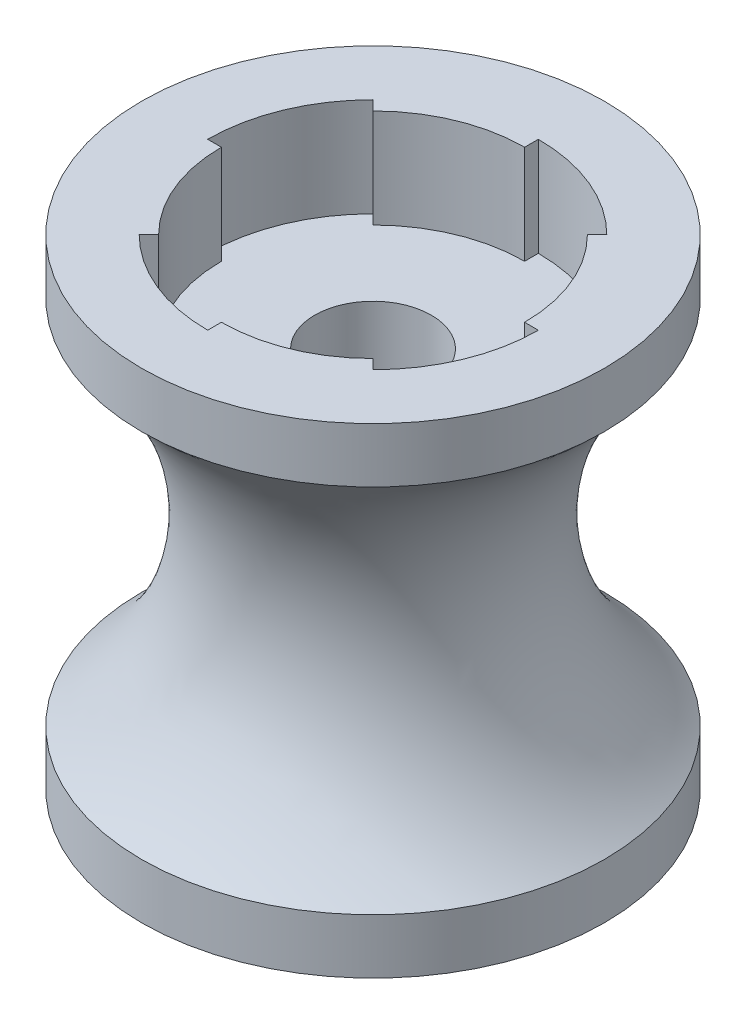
ISO-10303-21;
HEADER;
FILE_DESCRIPTION(('STEP AP214'),'2;1');
FILE_NAME('part.step','',(''),(''),'','','');
FILE_SCHEMA(('AUTOMOTIVE_DESIGN { 1 0 10303 214 1 1 1 1 }'));
ENDSEC;
DATA;
#1=APPLICATION_CONTEXT('core data for automotive mechanical design processes');
#2=APPLICATION_PROTOCOL_DEFINITION('international standard','automotive_design',2000,#1);
#3=PRODUCT_CONTEXT('',#1,'mechanical');
#4=PRODUCT('Part','Part','',(#3));
#5=PRODUCT_RELATED_PRODUCT_CATEGORY('part','',(#4));
#6=PRODUCT_DEFINITION_FORMATION('','',#4);
#7=PRODUCT_DEFINITION_CONTEXT('part definition',#1,'design');
#8=PRODUCT_DEFINITION('design','',#6,#7);
#9=PRODUCT_DEFINITION_SHAPE('','',#8);
#10=(LENGTH_UNIT() NAMED_UNIT(*) SI_UNIT(.MILLI.,.METRE.));
#11=(NAMED_UNIT(*) PLANE_ANGLE_UNIT() SI_UNIT($,.RADIAN.));
#12=(NAMED_UNIT(*) SI_UNIT($,.STERADIAN.) SOLID_ANGLE_UNIT());
#13=UNCERTAINTY_MEASURE_WITH_UNIT(LENGTH_MEASURE(1.E-05),#10,'distance_accuracy_value','');
#14=(GEOMETRIC_REPRESENTATION_CONTEXT(3) GLOBAL_UNCERTAINTY_ASSIGNED_CONTEXT((#13)) GLOBAL_UNIT_ASSIGNED_CONTEXT((#10,
#11,#12)) REPRESENTATION_CONTEXT('',''));
#15=CARTESIAN_POINT('',(0.,0.,0.));
#16=DIRECTION('',(0.,0.,1.));
#17=DIRECTION('',(1.,0.,0.));
#18=AXIS2_PLACEMENT_3D('',#15,#16,#17);
#19=CARTESIAN_POINT('',(0.,0.,0.));
#20=DIRECTION('',(0.,1.,0.));
#21=DIRECTION('',(0.,0.,1.));
#22=AXIS2_PLACEMENT_3D('',#19,#20,#21);
#23=PLANE('',#22);
#24=CARTESIAN_POINT('',(0.,0.,0.));
#25=DIRECTION('',(0.,-1.,0.));
#26=DIRECTION('',(0.,0.,-1.));
#27=AXIS2_PLACEMENT_3D('',#24,#25,#26);
#28=CIRCLE('',#27,16.8644712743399);
#29=CARTESIAN_POINT('',(0.,0.,-16.8644712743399));
#30=VERTEX_POINT('',#29);
#31=EDGE_CURVE('E11',#30,#30,#28,.T.);
#32=ORIENTED_EDGE('',*,*,#31,.T.);
#33=EDGE_LOOP('',(#32));
#34=FACE_BOUND('',#33,.T.);
#35=DIRECTION('',(1.,0.,0.));
#36=VECTOR('',#35,1.);
#37=CARTESIAN_POINT('',(0.,0.,0.));
#38=LINE('',#37,#36);
#39=CARTESIAN_POINT('',(-12.05,0.,0.));
#40=VERTEX_POINT('',#39);
#41=CARTESIAN_POINT('',(-11.05,0.,0.));
#42=VERTEX_POINT('',#41);
#43=EDGE_CURVE('E390',#40,#42,#38,.T.);
#44=ORIENTED_EDGE('',*,*,#43,.T.);
#45=CARTESIAN_POINT('',(0.,0.,0.));
#46=DIRECTION('',(0.,-1.,0.));
#47=DIRECTION('',(0.,0.,-1.));
#48=AXIS2_PLACEMENT_3D('',#45,#46,#47);
#49=CIRCLE('',#48,11.05);
#50=CARTESIAN_POINT('',(-7.81352993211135,0.,7.81352993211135));
#51=VERTEX_POINT('',#50);
#52=EDGE_CURVE('E479',#51,#42,#49,.T.);
#53=ORIENTED_EDGE('',*,*,#52,.F.);
#54=DIRECTION('',(0.707106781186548,0.,-0.707106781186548));
#55=VECTOR('',#54,1.);
#56=CARTESIAN_POINT('',(0.,0.,0.));
#57=LINE('',#56,#55);
#58=CARTESIAN_POINT('',(-8.5206367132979,0.,8.5206367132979));
#59=VERTEX_POINT('',#58);
#60=EDGE_CURVE('E458',#59,#51,#57,.T.);
#61=ORIENTED_EDGE('',*,*,#60,.F.);
#62=CARTESIAN_POINT('',(0.,0.,0.));
#63=DIRECTION('',(0.,-1.,0.));
#64=DIRECTION('',(0.,0.,-1.));
#65=AXIS2_PLACEMENT_3D('',#62,#63,#64);
#66=CIRCLE('',#65,12.05);
#67=CARTESIAN_POINT('',(0.,0.,12.05));
#68=VERTEX_POINT('',#67);
#69=EDGE_CURVE('E402',#59,#68,#66,.F.);
#70=ORIENTED_EDGE('',*,*,#69,.T.);
#71=DIRECTION('',(0.,0.,-1.));
#72=VECTOR('',#71,1.);
#73=CARTESIAN_POINT('',(0.,0.,0.));
#74=LINE('',#73,#72);
#75=CARTESIAN_POINT('',(0.,0.,11.05));
#76=VERTEX_POINT('',#75);
#77=EDGE_CURVE('E460',#68,#76,#74,.T.);
#78=ORIENTED_EDGE('',*,*,#77,.T.);
#79=CARTESIAN_POINT('',(7.81352993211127,0.,7.81352993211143));
#80=VERTEX_POINT('',#79);
#81=EDGE_CURVE('E473',#80,#76,#49,.T.);
#82=ORIENTED_EDGE('',*,*,#81,.F.);
#83=DIRECTION('',(-0.70710678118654,0.,-0.707106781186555));
#84=VECTOR('',#83,1.);
#85=CARTESIAN_POINT('',(0.,0.,0.));
#86=LINE('',#85,#84);
#87=CARTESIAN_POINT('',(8.52063671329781,0.,8.52063671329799));
#88=VERTEX_POINT('',#87);
#89=EDGE_CURVE('E434',#88,#80,#86,.T.);
#90=ORIENTED_EDGE('',*,*,#89,.F.);
#91=CARTESIAN_POINT('',(0.,0.,0.));
#92=DIRECTION('',(0.,-1.,0.));
#93=DIRECTION('',(-1.,0.,0.));
#94=AXIS2_PLACEMENT_3D('',#91,#92,#93);
#95=CIRCLE('',#94,12.05);
#96=CARTESIAN_POINT('',(12.05,0.,1.26217050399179E-13));
#97=VERTEX_POINT('',#96);
#98=EDGE_CURVE('E374',#88,#97,#95,.F.);
#99=ORIENTED_EDGE('',*,*,#98,.T.);
#100=DIRECTION('',(-1.,0.,0.));
#101=VECTOR('',#100,1.);
#102=CARTESIAN_POINT('',(0.,0.,0.));
#103=LINE('',#102,#101);
#104=CARTESIAN_POINT('',(11.05,0.,1.1574260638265E-13));
#105=VERTEX_POINT('',#104);
#106=EDGE_CURVE('E436',#97,#105,#103,.T.);
#107=ORIENTED_EDGE('',*,*,#106,.T.);
#108=CARTESIAN_POINT('',(7.81352993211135,0.,-7.81352993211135));
#109=VERTEX_POINT('',#108);
#110=EDGE_CURVE('E554',#109,#105,#49,.T.);
#111=ORIENTED_EDGE('',*,*,#110,.F.);
#112=DIRECTION('',(-0.707106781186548,0.,0.707106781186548));
#113=VECTOR('',#112,1.);
#114=CARTESIAN_POINT('',(0.,0.,0.));
#115=LINE('',#114,#113);
#116=CARTESIAN_POINT('',(8.5206367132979,0.,-8.5206367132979));
#117=VERTEX_POINT('',#116);
#118=EDGE_CURVE('E412',#117,#109,#115,.T.);
#119=ORIENTED_EDGE('',*,*,#118,.F.);
#120=CARTESIAN_POINT('',(0.,0.,0.));
#121=DIRECTION('',(0.,-1.,0.));
#122=DIRECTION('',(0.,0.,1.));
#123=AXIS2_PLACEMENT_3D('',#120,#121,#122);
#124=CIRCLE('',#123,12.05);
#125=CARTESIAN_POINT('',(0.,0.,-12.05));
#126=VERTEX_POINT('',#125);
#127=EDGE_CURVE('E409',#117,#126,#124,.F.);
#128=ORIENTED_EDGE('',*,*,#127,.T.);
#129=DIRECTION('',(0.,0.,1.));
#130=VECTOR('',#129,1.);
#131=CARTESIAN_POINT('',(0.,0.,0.));
#132=LINE('',#131,#130);
#133=CARTESIAN_POINT('',(0.,0.,-11.05));
#134=VERTEX_POINT('',#133);
#135=EDGE_CURVE('E414',#126,#134,#132,.T.);
#136=ORIENTED_EDGE('',*,*,#135,.T.);
#137=CARTESIAN_POINT('',(-7.81352993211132,0.,-7.81352993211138));
#138=VERTEX_POINT('',#137);
#139=EDGE_CURVE('E482',#138,#134,#49,.T.);
#140=ORIENTED_EDGE('',*,*,#139,.F.);
#141=DIRECTION('',(0.707106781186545,0.,0.70710678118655));
#142=VECTOR('',#141,1.);
#143=CARTESIAN_POINT('',(0.,0.,0.));
#144=LINE('',#143,#142);
#145=CARTESIAN_POINT('',(-8.52063671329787,0.,-8.52063671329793));
#146=VERTEX_POINT('',#145);
#147=EDGE_CURVE('E388',#146,#138,#144,.T.);
#148=ORIENTED_EDGE('',*,*,#147,.F.);
#149=CARTESIAN_POINT('',(0.,0.,0.));
#150=DIRECTION('',(0.,-1.,0.));
#151=DIRECTION('',(1.,0.,0.));
#152=AXIS2_PLACEMENT_3D('',#149,#150,#151);
#153=CIRCLE('',#152,12.05);
#154=EDGE_CURVE('E385',#146,#40,#153,.F.);
#155=ORIENTED_EDGE('',*,*,#154,.T.);
#156=EDGE_LOOP('',(#44,#53,#61,#70,#78,#82,#90,#99,#107,#111,#119,#128,#136,#140,#148,#155));
#157=FACE_BOUND('',#156,.T.);
#158=ADVANCED_FACE('F34',(#34,#157),#23,.F.);
#159=CARTESIAN_POINT('',(0.,7.2,0.));
#160=DIRECTION('',(0.,-1.,0.));
#161=DIRECTION('',(0.,0.,-1.));
#162=AXIS2_PLACEMENT_3D('',#159,#160,#161);
#163=CYLINDRICAL_SURFACE('',#162,11.05);
#164=DIRECTION('',(0.,-1.,0.));
#165=VECTOR('',#164,1.);
#166=CARTESIAN_POINT('',(-11.05,16.7157200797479,0.));
#167=LINE('',#166,#165);
#168=CARTESIAN_POINT('',(-11.05,7.2,0.));
#169=VERTEX_POINT('',#168);
#170=EDGE_CURVE('E395',#169,#42,#167,.T.);
#171=ORIENTED_EDGE('',*,*,#170,.F.);
#172=CARTESIAN_POINT('',(0.,7.2,0.));
#173=DIRECTION('',(0.,-1.,0.));
#174=DIRECTION('',(0.,0.,-1.));
#175=AXIS2_PLACEMENT_3D('',#172,#173,#174);
#176=CIRCLE('',#175,11.05);
#177=CARTESIAN_POINT('',(-7.81352993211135,7.2,7.81352993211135));
#178=VERTEX_POINT('',#177);
#179=EDGE_CURVE('E474',#178,#169,#176,.T.);
#180=ORIENTED_EDGE('',*,*,#179,.F.);
#181=DIRECTION('',(0.,-1.,0.));
#182=VECTOR('',#181,1.);
#183=CARTESIAN_POINT('',(-7.81352993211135,16.7157200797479,7.81352993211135));
#184=LINE('',#183,#182);
#185=EDGE_CURVE('E468',#178,#51,#184,.T.);
#186=ORIENTED_EDGE('',*,*,#185,.T.);
#187=ORIENTED_EDGE('',*,*,#52,.T.);
#188=EDGE_LOOP('',(#171,#180,#186,#187));
#189=FACE_BOUND('',#188,.T.);
#190=ADVANCED_FACE('F518',(#189),#163,.F.);
#191=CARTESIAN_POINT('',(-7.81352993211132,7.2,-7.81352993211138));
#192=VERTEX_POINT('',#191);
#193=CARTESIAN_POINT('',(0.,7.2,-11.05));
#194=VERTEX_POINT('',#193);
#195=EDGE_CURVE('E477',#192,#194,#176,.T.);
#196=ORIENTED_EDGE('',*,*,#195,.F.);
#197=DIRECTION('',(0.,-1.,0.));
#198=VECTOR('',#197,1.);
#199=CARTESIAN_POINT('',(-7.81352993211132,16.7157200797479,-7.81352993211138));
#200=LINE('',#199,#198);
#201=EDGE_CURVE('E397',#192,#138,#200,.T.);
#202=ORIENTED_EDGE('',*,*,#201,.T.);
#203=ORIENTED_EDGE('',*,*,#139,.T.);
#204=DIRECTION('',(0.,-1.,0.));
#205=VECTOR('',#204,1.);
#206=CARTESIAN_POINT('',(0.,16.7157200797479,-11.05));
#207=LINE('',#206,#205);
#208=EDGE_CURVE('E419',#194,#134,#207,.T.);
#209=ORIENTED_EDGE('',*,*,#208,.F.);
#210=EDGE_LOOP('',(#196,#202,#203,#209));
#211=FACE_BOUND('',#210,.T.);
#212=ADVANCED_FACE('F523',(#211),#163,.F.);
#213=CARTESIAN_POINT('',(7.81352993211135,7.2,-7.81352993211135));
#214=VERTEX_POINT('',#213);
#215=CARTESIAN_POINT('',(11.05,7.2,1.15737990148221E-13));
#216=VERTEX_POINT('',#215);
#217=EDGE_CURVE('E573',#214,#216,#176,.T.);
#218=ORIENTED_EDGE('',*,*,#217,.F.);
#219=DIRECTION('',(0.,-1.,0.));
#220=VECTOR('',#219,1.);
#221=CARTESIAN_POINT('',(7.81352993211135,16.7157200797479,-7.81352993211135));
#222=LINE('',#221,#220);
#223=EDGE_CURVE('E421',#214,#109,#222,.T.);
#224=ORIENTED_EDGE('',*,*,#223,.T.);
#225=ORIENTED_EDGE('',*,*,#110,.T.);
#226=DIRECTION('',(0.,-1.,0.));
#227=VECTOR('',#226,1.);
#228=CARTESIAN_POINT('',(11.05,16.7157200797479,1.15733373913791E-13));
#229=LINE('',#228,#227);
#230=EDGE_CURVE('E441',#216,#105,#229,.T.);
#231=ORIENTED_EDGE('',*,*,#230,.F.);
#232=EDGE_LOOP('',(#218,#224,#225,#231));
#233=FACE_BOUND('',#232,.T.);
#234=ADVANCED_FACE('F625',(#233),#163,.F.);
#235=CARTESIAN_POINT('',(7.81352993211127,7.2,7.81352993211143));
#236=VERTEX_POINT('',#235);
#237=CARTESIAN_POINT('',(0.,7.2,11.05));
#238=VERTEX_POINT('',#237);
#239=EDGE_CURVE('E478',#236,#238,#176,.T.);
#240=ORIENTED_EDGE('',*,*,#239,.F.);
#241=DIRECTION('',(0.,-1.,0.));
#242=VECTOR('',#241,1.);
#243=CARTESIAN_POINT('',(7.81352993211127,16.7157200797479,7.81352993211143));
#244=LINE('',#243,#242);
#245=EDGE_CURVE('E443',#236,#80,#244,.T.);
#246=ORIENTED_EDGE('',*,*,#245,.T.);
#247=ORIENTED_EDGE('',*,*,#81,.T.);
#248=DIRECTION('',(0.,-1.,0.));
#249=VECTOR('',#248,1.);
#250=CARTESIAN_POINT('',(0.,16.7157200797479,11.05));
#251=LINE('',#250,#249);
#252=EDGE_CURVE('E465',#238,#76,#251,.T.);
#253=ORIENTED_EDGE('',*,*,#252,.F.);
#254=EDGE_LOOP('',(#240,#246,#247,#253));
#255=FACE_BOUND('',#254,.T.);
#256=ADVANCED_FACE('F495',(#255),#163,.F.);
#257=CARTESIAN_POINT('',(0.,87.,0.));
#258=DIRECTION('',(0.,-1.,0.));
#259=DIRECTION('',(0.,0.,-1.));
#260=AXIS2_PLACEMENT_3D('',#257,#258,#259);
#261=CYLINDRICAL_SURFACE('',#260,4.25);
#262=CARTESIAN_POINT('',(0.,7.2,0.));
#263=DIRECTION('',(0.,-1.,0.));
#264=DIRECTION('',(0.,0.,-1.));
#265=AXIS2_PLACEMENT_3D('',#262,#263,#264);
#266=CIRCLE('',#265,4.25);
#267=CARTESIAN_POINT('',(0.,7.2,-4.25));
#268=VERTEX_POINT('',#267);
#269=EDGE_CURVE('E37',#268,#268,#266,.F.);
#270=ORIENTED_EDGE('',*,*,#269,.F.);
#271=EDGE_LOOP('',(#270));
#272=FACE_BOUND('',#271,.T.);
#273=CARTESIAN_POINT('',(0.,27.8,0.));
#274=DIRECTION('',(0.,-1.,0.));
#275=DIRECTION('',(0.,0.,-1.));
#276=AXIS2_PLACEMENT_3D('',#273,#274,#275);
#277=CIRCLE('',#276,4.25);
#278=CARTESIAN_POINT('',(0.,27.8,-4.25));
#279=VERTEX_POINT('',#278);
#280=EDGE_CURVE('E362',#279,#279,#277,.F.);
#281=ORIENTED_EDGE('',*,*,#280,.T.);
#282=EDGE_LOOP('',(#281));
#283=FACE_BOUND('',#282,.T.);
#284=ADVANCED_FACE('F491',(#272,#283),#261,.F.);
#285=CARTESIAN_POINT('',(0.,0.,0.));
#286=DIRECTION('',(0.,-1.,0.));
#287=DIRECTION('',(0.,0.,-1.));
#288=AXIS2_PLACEMENT_3D('',#285,#286,#287);
#289=CYLINDRICAL_SURFACE('',#288,16.86447127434);
#290=ORIENTED_EDGE('',*,*,#31,.F.);
#291=EDGE_LOOP('',(#290));
#292=FACE_BOUND('',#291,.T.);
#293=CARTESIAN_POINT('',(0.,3.99999999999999,0.));
#294=DIRECTION('',(0.,-1.,0.));
#295=DIRECTION('',(0.,0.,-1.));
#296=AXIS2_PLACEMENT_3D('',#293,#294,#295);
#297=CIRCLE('',#296,16.86447127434);
#298=CARTESIAN_POINT('',(0.,3.99999999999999,-16.86447127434));
#299=VERTEX_POINT('',#298);
#300=EDGE_CURVE('E42',#299,#299,#297,.T.);
#301=ORIENTED_EDGE('',*,*,#300,.T.);
#302=EDGE_LOOP('',(#301));
#303=FACE_BOUND('',#302,.T.);
#304=ADVANCED_FACE('F494',(#292,#303),#289,.T.);
#305=CARTESIAN_POINT('',(0.,17.5,0.));
#306=DIRECTION('',(0.,-1.,0.));
#307=DIRECTION('',(0.,0.,-1.));
#308=AXIS2_PLACEMENT_3D('',#305,#306,#307);
#309=TOROIDAL_SURFACE('',#308,28.,17.5);
#310=ORIENTED_EDGE('',*,*,#300,.F.);
#311=EDGE_LOOP('',(#310));
#312=FACE_BOUND('',#311,.T.);
#313=CARTESIAN_POINT('',(0.,31.,0.));
#314=DIRECTION('',(0.,-1.,0.));
#315=DIRECTION('',(0.,0.,-1.));
#316=AXIS2_PLACEMENT_3D('',#313,#314,#315);
#317=CIRCLE('',#316,16.86447127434);
#318=CARTESIAN_POINT('',(0.,31.,-16.86447127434));
#319=VERTEX_POINT('',#318);
#320=EDGE_CURVE('E368',#319,#319,#317,.T.);
#321=ORIENTED_EDGE('',*,*,#320,.T.);
#322=EDGE_LOOP('',(#321));
#323=FACE_BOUND('',#322,.T.);
#324=ADVANCED_FACE('F623',(#312,#323),#309,.F.);
#325=CARTESIAN_POINT('',(0.,7.2,0.));
#326=DIRECTION('',(0.,-1.,0.));
#327=DIRECTION('',(0.,0.,-1.));
#328=AXIS2_PLACEMENT_3D('',#325,#326,#327);
#329=PLANE('',#328);
#330=ORIENTED_EDGE('',*,*,#179,.T.);
#331=DIRECTION('',(-1.,0.,0.));
#332=VECTOR('',#331,1.);
#333=CARTESIAN_POINT('',(0.,7.2,0.));
#334=LINE('',#333,#332);
#335=CARTESIAN_POINT('',(-12.05,7.2,0.));
#336=VERTEX_POINT('',#335);
#337=EDGE_CURVE('E377',#169,#336,#334,.T.);
#338=ORIENTED_EDGE('',*,*,#337,.T.);
#339=CARTESIAN_POINT('',(0.,7.2,0.));
#340=DIRECTION('',(0.,-1.,0.));
#341=DIRECTION('',(0.,0.,-1.));
#342=AXIS2_PLACEMENT_3D('',#339,#340,#341);
#343=CIRCLE('',#342,12.05);
#344=CARTESIAN_POINT('',(-8.52063671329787,7.2,-8.52063671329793));
#345=VERTEX_POINT('',#344);
#346=EDGE_CURVE('E380',#336,#345,#343,.T.);
#347=ORIENTED_EDGE('',*,*,#346,.T.);
#348=DIRECTION('',(-0.707106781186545,0.,-0.70710678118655));
#349=VECTOR('',#348,1.);
#350=CARTESIAN_POINT('',(0.,7.2,0.));
#351=LINE('',#350,#349);
#352=EDGE_CURVE('E384',#192,#345,#351,.T.);
#353=ORIENTED_EDGE('',*,*,#352,.F.);
#354=ORIENTED_EDGE('',*,*,#195,.T.);
#355=DIRECTION('',(0.,0.,-1.));
#356=VECTOR('',#355,1.);
#357=CARTESIAN_POINT('',(0.,7.2,0.));
#358=LINE('',#357,#356);
#359=CARTESIAN_POINT('',(0.,7.2,-12.05));
#360=VERTEX_POINT('',#359);
#361=EDGE_CURVE('E403',#194,#360,#358,.T.);
#362=ORIENTED_EDGE('',*,*,#361,.T.);
#363=CARTESIAN_POINT('',(0.,7.2,0.));
#364=DIRECTION('',(0.,-1.,0.));
#365=DIRECTION('',(0.,0.,-1.));
#366=AXIS2_PLACEMENT_3D('',#363,#364,#365);
#367=CIRCLE('',#366,12.05);
#368=CARTESIAN_POINT('',(8.5206367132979,7.2,-8.5206367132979));
#369=VERTEX_POINT('',#368);
#370=EDGE_CURVE('E406',#360,#369,#367,.T.);
#371=ORIENTED_EDGE('',*,*,#370,.T.);
#372=DIRECTION('',(0.707106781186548,0.,-0.707106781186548));
#373=VECTOR('',#372,1.);
#374=CARTESIAN_POINT('',(0.,7.2,0.));
#375=LINE('',#374,#373);
#376=EDGE_CURVE('E56',#214,#369,#375,.T.);
#377=ORIENTED_EDGE('',*,*,#376,.F.);
#378=ORIENTED_EDGE('',*,*,#217,.T.);
#379=DIRECTION('',(1.,0.,0.));
#380=VECTOR('',#379,1.);
#381=CARTESIAN_POINT('',(0.,7.2,0.));
#382=LINE('',#381,#380);
#383=CARTESIAN_POINT('',(12.05,7.2,1.2621307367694E-13));
#384=VERTEX_POINT('',#383);
#385=EDGE_CURVE('E426',#216,#384,#382,.T.);
#386=ORIENTED_EDGE('',*,*,#385,.T.);
#387=CARTESIAN_POINT('',(0.,7.2,0.));
#388=DIRECTION('',(0.,-1.,0.));
#389=DIRECTION('',(0.,0.,-1.));
#390=AXIS2_PLACEMENT_3D('',#387,#388,#389);
#391=CIRCLE('',#390,12.05);
#392=CARTESIAN_POINT('',(8.52063671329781,7.2,8.52063671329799));
#393=VERTEX_POINT('',#392);
#394=EDGE_CURVE('E429',#384,#393,#391,.T.);
#395=ORIENTED_EDGE('',*,*,#394,.T.);
#396=DIRECTION('',(0.70710678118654,0.,0.707106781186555));
#397=VECTOR('',#396,1.);
#398=CARTESIAN_POINT('',(0.,7.2,0.));
#399=LINE('',#398,#397);
#400=EDGE_CURVE('E49',#236,#393,#399,.T.);
#401=ORIENTED_EDGE('',*,*,#400,.F.);
#402=ORIENTED_EDGE('',*,*,#239,.T.);
#403=DIRECTION('',(0.,0.,1.));
#404=VECTOR('',#403,1.);
#405=CARTESIAN_POINT('',(0.,7.2,0.));
#406=LINE('',#405,#404);
#407=CARTESIAN_POINT('',(0.,7.2,12.05));
#408=VERTEX_POINT('',#407);
#409=EDGE_CURVE('E448',#238,#408,#406,.T.);
#410=ORIENTED_EDGE('',*,*,#409,.T.);
#411=CARTESIAN_POINT('',(0.,7.2,0.));
#412=DIRECTION('',(0.,-1.,0.));
#413=DIRECTION('',(0.,0.,-1.));
#414=AXIS2_PLACEMENT_3D('',#411,#412,#413);
#415=CIRCLE('',#414,12.05);
#416=CARTESIAN_POINT('',(-8.5206367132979,7.2,8.5206367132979));
#417=VERTEX_POINT('',#416);
#418=EDGE_CURVE('E451',#408,#417,#415,.T.);
#419=ORIENTED_EDGE('',*,*,#418,.T.);
#420=DIRECTION('',(-0.707106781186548,0.,0.707106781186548));
#421=VECTOR('',#420,1.);
#422=CARTESIAN_POINT('',(0.,7.2,0.));
#423=LINE('',#422,#421);
#424=EDGE_CURVE('E455',#178,#417,#423,.T.);
#425=ORIENTED_EDGE('',*,*,#424,.F.);
#426=EDGE_LOOP('',(#330,#338,#347,#353,#354,#362,#371,#377,#378,#386,#395,#401,#402,#410,#419,#425));
#427=FACE_BOUND('',#426,.T.);
#428=ORIENTED_EDGE('',*,*,#269,.T.);
#429=EDGE_LOOP('',(#428));
#430=FACE_BOUND('',#429,.T.);
#431=ADVANCED_FACE('F489',(#427,#430),#329,.T.);
#432=CARTESIAN_POINT('',(0.,16.7157200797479,0.));
#433=DIRECTION('',(0.,-1.,0.));
#434=DIRECTION('',(0.,0.,-1.));
#435=AXIS2_PLACEMENT_3D('',#432,#433,#434);
#436=CYLINDRICAL_SURFACE('',#435,12.05);
#437=DIRECTION('',(0.,-1.,0.));
#438=VECTOR('',#437,1.);
#439=CARTESIAN_POINT('',(0.,16.7157200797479,12.05));
#440=LINE('',#439,#438);
#441=EDGE_CURVE('E452',#408,#68,#440,.T.);
#442=ORIENTED_EDGE('',*,*,#441,.T.);
#443=ORIENTED_EDGE('',*,*,#69,.F.);
#444=DIRECTION('',(0.,-1.,0.));
#445=VECTOR('',#444,1.);
#446=CARTESIAN_POINT('',(-8.5206367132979,16.7157200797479,8.5206367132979));
#447=LINE('',#446,#445);
#448=EDGE_CURVE('E463',#417,#59,#447,.T.);
#449=ORIENTED_EDGE('',*,*,#448,.F.);
#450=ORIENTED_EDGE('',*,*,#418,.F.);
#451=EDGE_LOOP('',(#442,#443,#449,#450));
#452=FACE_BOUND('',#451,.T.);
#453=ADVANCED_FACE('F545',(#452),#436,.F.);
#454=CARTESIAN_POINT('',(0.,16.7157200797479,0.));
#455=DIRECTION('',(-1.,0.,0.));
#456=DIRECTION('',(0.,0.,1.));
#457=AXIS2_PLACEMENT_3D('',#454,#455,#456);
#458=PLANE('',#457);
#459=ORIENTED_EDGE('',*,*,#252,.T.);
#460=ORIENTED_EDGE('',*,*,#77,.F.);
#461=ORIENTED_EDGE('',*,*,#441,.F.);
#462=ORIENTED_EDGE('',*,*,#409,.F.);
#463=EDGE_LOOP('',(#459,#460,#461,#462));
#464=FACE_BOUND('',#463,.T.);
#465=ADVANCED_FACE('F549',(#464),#458,.T.);
#466=CARTESIAN_POINT('',(0.,16.7157200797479,0.));
#467=DIRECTION('',(-0.707106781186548,0.,-0.707106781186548));
#468=DIRECTION('',(-0.707106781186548,0.,0.707106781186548));
#469=AXIS2_PLACEMENT_3D('',#466,#467,#468);
#470=PLANE('',#469);
#471=ORIENTED_EDGE('',*,*,#424,.T.);
#472=ORIENTED_EDGE('',*,*,#448,.T.);
#473=ORIENTED_EDGE('',*,*,#60,.T.);
#474=ORIENTED_EDGE('',*,*,#185,.F.);
#475=EDGE_LOOP('',(#471,#472,#473,#474));
#476=FACE_BOUND('',#475,.T.);
#477=ADVANCED_FACE('F539',(#476),#470,.F.);
#478=CARTESIAN_POINT('',(0.,16.7157200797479,0.));
#479=DIRECTION('',(0.,-1.,0.));
#480=DIRECTION('',(0.,0.,-1.));
#481=AXIS2_PLACEMENT_3D('',#478,#479,#480);
#482=CYLINDRICAL_SURFACE('',#481,12.05);
#483=DIRECTION('',(0.,-1.,0.));
#484=VECTOR('',#483,1.);
#485=CARTESIAN_POINT('',(12.05,16.7157200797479,1.26207817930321E-13));
#486=LINE('',#485,#484);
#487=EDGE_CURVE('E430',#384,#97,#486,.T.);
#488=ORIENTED_EDGE('',*,*,#487,.T.);
#489=ORIENTED_EDGE('',*,*,#98,.F.);
#490=DIRECTION('',(0.,-1.,0.));
#491=VECTOR('',#490,1.);
#492=CARTESIAN_POINT('',(8.52063671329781,16.7157200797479,8.52063671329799));
#493=LINE('',#492,#491);
#494=EDGE_CURVE('E439',#393,#88,#493,.T.);
#495=ORIENTED_EDGE('',*,*,#494,.F.);
#496=ORIENTED_EDGE('',*,*,#394,.F.);
#497=EDGE_LOOP('',(#488,#489,#495,#496));
#498=FACE_BOUND('',#497,.T.);
#499=ADVANCED_FACE('F608',(#498),#482,.F.);
#500=CARTESIAN_POINT('',(0.,16.7157200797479,0.));
#501=DIRECTION('',(0.,0.,1.));
#502=DIRECTION('',(1.,0.,0.));
#503=AXIS2_PLACEMENT_3D('',#500,#501,#502);
#504=PLANE('',#503);
#505=ORIENTED_EDGE('',*,*,#230,.T.);
#506=ORIENTED_EDGE('',*,*,#106,.F.);
#507=ORIENTED_EDGE('',*,*,#487,.F.);
#508=ORIENTED_EDGE('',*,*,#385,.F.);
#509=EDGE_LOOP('',(#505,#506,#507,#508));
#510=FACE_BOUND('',#509,.T.);
#511=ADVANCED_FACE('F605',(#510),#504,.T.);
#512=CARTESIAN_POINT('',(0.,16.7157200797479,0.));
#513=DIRECTION('',(-0.707106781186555,0.,0.70710678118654));
#514=DIRECTION('',(0.70710678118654,0.,0.707106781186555));
#515=AXIS2_PLACEMENT_3D('',#512,#513,#514);
#516=PLANE('',#515);
#517=ORIENTED_EDGE('',*,*,#400,.T.);
#518=ORIENTED_EDGE('',*,*,#494,.T.);
#519=ORIENTED_EDGE('',*,*,#89,.T.);
#520=ORIENTED_EDGE('',*,*,#245,.F.);
#521=EDGE_LOOP('',(#517,#518,#519,#520));
#522=FACE_BOUND('',#521,.T.);
#523=ADVANCED_FACE('F603',(#522),#516,.F.);
#524=CARTESIAN_POINT('',(0.,16.7157200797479,0.));
#525=DIRECTION('',(0.,-1.,0.));
#526=DIRECTION('',(0.,0.,-1.));
#527=AXIS2_PLACEMENT_3D('',#524,#525,#526);
#528=CYLINDRICAL_SURFACE('',#527,12.05);
#529=DIRECTION('',(0.,-1.,0.));
#530=VECTOR('',#529,1.);
#531=CARTESIAN_POINT('',(0.,16.7157200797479,-12.05));
#532=LINE('',#531,#530);
#533=EDGE_CURVE('E407',#360,#126,#532,.T.);
#534=ORIENTED_EDGE('',*,*,#533,.T.);
#535=ORIENTED_EDGE('',*,*,#127,.F.);
#536=DIRECTION('',(0.,-1.,0.));
#537=VECTOR('',#536,1.);
#538=CARTESIAN_POINT('',(8.5206367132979,16.7157200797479,-8.5206367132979));
#539=LINE('',#538,#537);
#540=EDGE_CURVE('E417',#369,#117,#539,.T.);
#541=ORIENTED_EDGE('',*,*,#540,.F.);
#542=ORIENTED_EDGE('',*,*,#370,.F.);
#543=EDGE_LOOP('',(#534,#535,#541,#542));
#544=FACE_BOUND('',#543,.T.);
#545=ADVANCED_FACE('F597',(#544),#528,.F.);
#546=CARTESIAN_POINT('',(0.,16.7157200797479,0.));
#547=DIRECTION('',(1.,0.,0.));
#548=DIRECTION('',(0.,0.,-1.));
#549=AXIS2_PLACEMENT_3D('',#546,#547,#548);
#550=PLANE('',#549);
#551=ORIENTED_EDGE('',*,*,#208,.T.);
#552=ORIENTED_EDGE('',*,*,#135,.F.);
#553=ORIENTED_EDGE('',*,*,#533,.F.);
#554=ORIENTED_EDGE('',*,*,#361,.F.);
#555=EDGE_LOOP('',(#551,#552,#553,#554));
#556=FACE_BOUND('',#555,.T.);
#557=ADVANCED_FACE('F571',(#556),#550,.T.);
#558=CARTESIAN_POINT('',(0.,16.7157200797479,0.));
#559=DIRECTION('',(0.707106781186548,0.,0.707106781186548));
#560=DIRECTION('',(0.707106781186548,0.,-0.707106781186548));
#561=AXIS2_PLACEMENT_3D('',#558,#559,#560);
#562=PLANE('',#561);
#563=ORIENTED_EDGE('',*,*,#376,.T.);
#564=ORIENTED_EDGE('',*,*,#540,.T.);
#565=ORIENTED_EDGE('',*,*,#118,.T.);
#566=ORIENTED_EDGE('',*,*,#223,.F.);
#567=EDGE_LOOP('',(#563,#564,#565,#566));
#568=FACE_BOUND('',#567,.T.);
#569=ADVANCED_FACE('F594',(#568),#562,.F.);
#570=CARTESIAN_POINT('',(0.,16.7157200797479,0.));
#571=DIRECTION('',(0.,-1.,0.));
#572=DIRECTION('',(0.,0.,-1.));
#573=AXIS2_PLACEMENT_3D('',#570,#571,#572);
#574=CYLINDRICAL_SURFACE('',#573,12.05);
#575=DIRECTION('',(0.,-1.,0.));
#576=VECTOR('',#575,1.);
#577=CARTESIAN_POINT('',(-12.05,16.7157200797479,0.));
#578=LINE('',#577,#576);
#579=EDGE_CURVE('E381',#336,#40,#578,.T.);
#580=ORIENTED_EDGE('',*,*,#579,.T.);
#581=ORIENTED_EDGE('',*,*,#154,.F.);
#582=DIRECTION('',(0.,-1.,0.));
#583=VECTOR('',#582,1.);
#584=CARTESIAN_POINT('',(-8.52063671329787,16.7157200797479,-8.52063671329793));
#585=LINE('',#584,#583);
#586=EDGE_CURVE('E393',#345,#146,#585,.T.);
#587=ORIENTED_EDGE('',*,*,#586,.F.);
#588=ORIENTED_EDGE('',*,*,#346,.F.);
#589=EDGE_LOOP('',(#580,#581,#587,#588));
#590=FACE_BOUND('',#589,.T.);
#591=ADVANCED_FACE('F578',(#590),#574,.F.);
#592=CARTESIAN_POINT('',(0.,16.7157200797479,0.));
#593=DIRECTION('',(0.,0.,-1.));
#594=DIRECTION('',(-1.,0.,0.));
#595=AXIS2_PLACEMENT_3D('',#592,#593,#594);
#596=PLANE('',#595);
#597=ORIENTED_EDGE('',*,*,#170,.T.);
#598=ORIENTED_EDGE('',*,*,#43,.F.);
#599=ORIENTED_EDGE('',*,*,#579,.F.);
#600=ORIENTED_EDGE('',*,*,#337,.F.);
#601=EDGE_LOOP('',(#597,#598,#599,#600));
#602=FACE_BOUND('',#601,.T.);
#603=ADVANCED_FACE('F576',(#602),#596,.T.);
#604=CARTESIAN_POINT('',(0.,16.7157200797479,0.));
#605=DIRECTION('',(0.70710678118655,0.,-0.707106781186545));
#606=DIRECTION('',(-0.707106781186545,0.,-0.70710678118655));
#607=AXIS2_PLACEMENT_3D('',#604,#605,#606);
#608=PLANE('',#607);
#609=ORIENTED_EDGE('',*,*,#352,.T.);
#610=ORIENTED_EDGE('',*,*,#586,.T.);
#611=ORIENTED_EDGE('',*,*,#147,.T.);
#612=ORIENTED_EDGE('',*,*,#201,.F.);
#613=EDGE_LOOP('',(#609,#610,#611,#612));
#614=FACE_BOUND('',#613,.T.);
#615=ADVANCED_FACE('F580',(#614),#608,.F.);
#616=CARTESIAN_POINT('',(0.,35.,0.));
#617=DIRECTION('',(0.,-1.,0.));
#618=DIRECTION('',(0.,0.,1.));
#619=AXIS2_PLACEMENT_3D('',#616,#617,#618);
#620=PLANE('',#619);
#621=CARTESIAN_POINT('',(0.,35.,0.));
#622=DIRECTION('',(0.,-1.,0.));
#623=DIRECTION('',(0.,0.,-1.));
#624=AXIS2_PLACEMENT_3D('',#621,#622,#623);
#625=CIRCLE('',#624,16.8644712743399);
#626=CARTESIAN_POINT('',(0.,35.,-16.8644712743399));
#627=VERTEX_POINT('',#626);
#628=EDGE_CURVE('E371',#627,#627,#625,.T.);
#629=ORIENTED_EDGE('',*,*,#628,.F.);
#630=EDGE_LOOP('',(#629));
#631=FACE_BOUND('',#630,.T.);
#632=DIRECTION('',(1.,0.,0.));
#633=VECTOR('',#632,1.);
#634=CARTESIAN_POINT('',(0.,35.,0.));
#635=LINE('',#634,#633);
#636=CARTESIAN_POINT('',(-12.05,35.,0.));
#637=VERTEX_POINT('',#636);
#638=CARTESIAN_POINT('',(-11.05,35.,0.));
#639=VERTEX_POINT('',#638);
#640=EDGE_CURVE('E254',#637,#639,#635,.T.);
#641=ORIENTED_EDGE('',*,*,#640,.F.);
#642=CARTESIAN_POINT('',(0.,35.,0.));
#643=DIRECTION('',(0.,-1.,0.));
#644=DIRECTION('',(1.,0.,0.));
#645=AXIS2_PLACEMENT_3D('',#642,#643,#644);
#646=CIRCLE('',#645,12.05);
#647=CARTESIAN_POINT('',(-8.52063671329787,35.,-8.52063671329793));
#648=VERTEX_POINT('',#647);
#649=EDGE_CURVE('E247',#648,#637,#646,.F.);
#650=ORIENTED_EDGE('',*,*,#649,.F.);
#651=DIRECTION('',(0.707106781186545,0.,0.70710678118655));
#652=VECTOR('',#651,1.);
#653=CARTESIAN_POINT('',(0.,35.,0.));
#654=LINE('',#653,#652);
#655=CARTESIAN_POINT('',(-7.81352993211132,35.,-7.81352993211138));
#656=VERTEX_POINT('',#655);
#657=EDGE_CURVE('E257',#648,#656,#654,.T.);
#658=ORIENTED_EDGE('',*,*,#657,.T.);
#659=CARTESIAN_POINT('',(0.,35.,0.));
#660=DIRECTION('',(0.,-1.,0.));
#661=DIRECTION('',(0.,0.,-1.));
#662=AXIS2_PLACEMENT_3D('',#659,#660,#661);
#663=CIRCLE('',#662,11.05);
#664=CARTESIAN_POINT('',(0.,35.,-11.05));
#665=VERTEX_POINT('',#664);
#666=EDGE_CURVE('E367',#656,#665,#663,.T.);
#667=ORIENTED_EDGE('',*,*,#666,.T.);
#668=DIRECTION('',(0.,0.,1.));
#669=VECTOR('',#668,1.);
#670=CARTESIAN_POINT('',(0.,35.,0.));
#671=LINE('',#670,#669);
#672=CARTESIAN_POINT('',(0.,35.,-12.05));
#673=VERTEX_POINT('',#672);
#674=EDGE_CURVE('E298',#673,#665,#671,.T.);
#675=ORIENTED_EDGE('',*,*,#674,.F.);
#676=CARTESIAN_POINT('',(0.,35.,0.));
#677=DIRECTION('',(0.,-1.,0.));
#678=DIRECTION('',(0.,0.,1.));
#679=AXIS2_PLACEMENT_3D('',#676,#677,#678);
#680=CIRCLE('',#679,12.05);
#681=CARTESIAN_POINT('',(8.5206367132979,35.,-8.5206367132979));
#682=VERTEX_POINT('',#681);
#683=EDGE_CURVE('E291',#682,#673,#680,.F.);
#684=ORIENTED_EDGE('',*,*,#683,.F.);
#685=DIRECTION('',(-0.707106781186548,0.,0.707106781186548));
#686=VECTOR('',#685,1.);
#687=CARTESIAN_POINT('',(0.,35.,0.));
#688=LINE('',#687,#686);
#689=CARTESIAN_POINT('',(7.81352993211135,35.,-7.81352993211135));
#690=VERTEX_POINT('',#689);
#691=EDGE_CURVE('E294',#682,#690,#688,.T.);
#692=ORIENTED_EDGE('',*,*,#691,.T.);
#693=CARTESIAN_POINT('',(11.05,35.,1.15723275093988E-13));
#694=VERTEX_POINT('',#693);
#695=EDGE_CURVE('E914',#690,#694,#663,.T.);
#696=ORIENTED_EDGE('',*,*,#695,.T.);
#697=DIRECTION('',(-1.,0.,0.));
#698=VECTOR('',#697,1.);
#699=CARTESIAN_POINT('',(0.,35.,0.));
#700=LINE('',#699,#698);
#701=CARTESIAN_POINT('',(12.05,35.,1.26197719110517E-13));
#702=VERTEX_POINT('',#701);
#703=EDGE_CURVE('E321',#702,#694,#700,.T.);
#704=ORIENTED_EDGE('',*,*,#703,.F.);
#705=CARTESIAN_POINT('',(0.,35.,0.));
#706=DIRECTION('',(0.,-1.,0.));
#707=DIRECTION('',(-1.,0.,0.));
#708=AXIS2_PLACEMENT_3D('',#705,#706,#707);
#709=CIRCLE('',#708,12.05);
#710=CARTESIAN_POINT('',(8.52063671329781,35.,8.52063671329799));
#711=VERTEX_POINT('',#710);
#712=EDGE_CURVE('E315',#711,#702,#709,.F.);
#713=ORIENTED_EDGE('',*,*,#712,.F.);
#714=DIRECTION('',(-0.70710678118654,0.,-0.707106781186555));
#715=VECTOR('',#714,1.);
#716=CARTESIAN_POINT('',(0.,35.,0.));
#717=LINE('',#716,#715);
#718=CARTESIAN_POINT('',(7.81352993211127,35.,7.81352993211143));
#719=VERTEX_POINT('',#718);
#720=EDGE_CURVE('E318',#711,#719,#717,.T.);
#721=ORIENTED_EDGE('',*,*,#720,.T.);
#722=CARTESIAN_POINT('',(0.,35.,11.05));
#723=VERTEX_POINT('',#722);
#724=EDGE_CURVE('E358',#719,#723,#663,.T.);
#725=ORIENTED_EDGE('',*,*,#724,.T.);
#726=DIRECTION('',(0.,0.,-1.));
#727=VECTOR('',#726,1.);
#728=CARTESIAN_POINT('',(0.,35.,0.));
#729=LINE('',#728,#727);
#730=CARTESIAN_POINT('',(0.,35.,12.05));
#731=VERTEX_POINT('',#730);
#732=EDGE_CURVE('E346',#731,#723,#729,.T.);
#733=ORIENTED_EDGE('',*,*,#732,.F.);
#734=CARTESIAN_POINT('',(0.,35.,0.));
#735=DIRECTION('',(0.,-1.,0.));
#736=DIRECTION('',(0.,0.,-1.));
#737=AXIS2_PLACEMENT_3D('',#734,#735,#736);
#738=CIRCLE('',#737,12.05);
#739=CARTESIAN_POINT('',(-8.5206367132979,35.,8.5206367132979));
#740=VERTEX_POINT('',#739);
#741=EDGE_CURVE('E284',#740,#731,#738,.F.);
#742=ORIENTED_EDGE('',*,*,#741,.F.);
#743=DIRECTION('',(0.707106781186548,0.,-0.707106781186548));
#744=VECTOR('',#743,1.);
#745=CARTESIAN_POINT('',(0.,35.,0.));
#746=LINE('',#745,#744);
#747=CARTESIAN_POINT('',(-7.81352993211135,35.,7.81352993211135));
#748=VERTEX_POINT('',#747);
#749=EDGE_CURVE('E343',#740,#748,#746,.T.);
#750=ORIENTED_EDGE('',*,*,#749,.T.);
#751=EDGE_CURVE('E365',#748,#639,#663,.T.);
#752=ORIENTED_EDGE('',*,*,#751,.T.);
#753=EDGE_LOOP('',(#641,#650,#658,#667,#675,#684,#692,#696,#704,#713,#721,#725,#733,#742,#750,#752));
#754=FACE_BOUND('',#753,.T.);
#755=ADVANCED_FACE('F264',(#631,#754),#620,.F.);
#756=CARTESIAN_POINT('',(0.,27.8,0.));
#757=DIRECTION('',(0.,1.,0.));
#758=DIRECTION('',(0.,0.,-1.));
#759=AXIS2_PLACEMENT_3D('',#756,#757,#758);
#760=CYLINDRICAL_SURFACE('',#759,11.05);
#761=DIRECTION('',(0.,1.,0.));
#762=VECTOR('',#761,1.);
#763=CARTESIAN_POINT('',(-11.05,18.2842799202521,0.));
#764=LINE('',#763,#762);
#765=CARTESIAN_POINT('',(-11.05,27.8,0.));
#766=VERTEX_POINT('',#765);
#767=EDGE_CURVE('E279',#766,#639,#764,.T.);
#768=ORIENTED_EDGE('',*,*,#767,.T.);
#769=ORIENTED_EDGE('',*,*,#751,.F.);
#770=DIRECTION('',(0.,1.,0.));
#771=VECTOR('',#770,1.);
#772=CARTESIAN_POINT('',(-7.81352993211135,18.2842799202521,7.81352993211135));
#773=LINE('',#772,#771);
#774=CARTESIAN_POINT('',(-7.81352993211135,27.8,7.81352993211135));
#775=VERTEX_POINT('',#774);
#776=EDGE_CURVE('E353',#775,#748,#773,.T.);
#777=ORIENTED_EDGE('',*,*,#776,.F.);
#778=CARTESIAN_POINT('',(0.,27.8,0.));
#779=DIRECTION('',(0.,-1.,0.));
#780=DIRECTION('',(0.,0.,-1.));
#781=AXIS2_PLACEMENT_3D('',#778,#779,#780);
#782=CIRCLE('',#781,11.05);
#783=EDGE_CURVE('E359',#775,#766,#782,.T.);
#784=ORIENTED_EDGE('',*,*,#783,.T.);
#785=EDGE_LOOP('',(#768,#769,#777,#784));
#786=FACE_BOUND('',#785,.T.);
#787=ADVANCED_FACE('F587',(#786),#760,.F.);
#788=CARTESIAN_POINT('',(-7.81352993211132,27.8,-7.81352993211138));
#789=VERTEX_POINT('',#788);
#790=CARTESIAN_POINT('',(0.,27.8,-11.05));
#791=VERTEX_POINT('',#790);
#792=EDGE_CURVE('E363',#789,#791,#782,.T.);
#793=ORIENTED_EDGE('',*,*,#792,.T.);
#794=DIRECTION('',(0.,1.,0.));
#795=VECTOR('',#794,1.);
#796=CARTESIAN_POINT('',(0.,18.2842799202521,-11.05));
#797=LINE('',#796,#795);
#798=EDGE_CURVE('E303',#791,#665,#797,.T.);
#799=ORIENTED_EDGE('',*,*,#798,.T.);
#800=ORIENTED_EDGE('',*,*,#666,.F.);
#801=DIRECTION('',(0.,1.,0.));
#802=VECTOR('',#801,1.);
#803=CARTESIAN_POINT('',(-7.81352993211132,18.2842799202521,-7.81352993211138));
#804=LINE('',#803,#802);
#805=EDGE_CURVE('E253',#789,#656,#804,.T.);
#806=ORIENTED_EDGE('',*,*,#805,.F.);
#807=EDGE_LOOP('',(#793,#799,#800,#806));
#808=FACE_BOUND('',#807,.T.);
#809=ADVANCED_FACE('F746',(#808),#760,.F.);
#810=CARTESIAN_POINT('',(7.81352993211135,27.8,-7.81352993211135));
#811=VERTEX_POINT('',#810);
#812=CARTESIAN_POINT('',(11.05,27.8,1.15726612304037E-13));
#813=VERTEX_POINT('',#812);
#814=EDGE_CURVE('E927',#811,#813,#782,.T.);
#815=ORIENTED_EDGE('',*,*,#814,.T.);
#816=DIRECTION('',(0.,1.,0.));
#817=VECTOR('',#816,1.);
#818=CARTESIAN_POINT('',(11.05,18.2842799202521,1.15732507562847E-13));
#819=LINE('',#818,#817);
#820=EDGE_CURVE('E326',#813,#694,#819,.T.);
#821=ORIENTED_EDGE('',*,*,#820,.T.);
#822=ORIENTED_EDGE('',*,*,#695,.F.);
#823=DIRECTION('',(0.,1.,0.));
#824=VECTOR('',#823,1.);
#825=CARTESIAN_POINT('',(7.81352993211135,18.2842799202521,-7.81352993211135));
#826=LINE('',#825,#824);
#827=EDGE_CURVE('E305',#811,#690,#826,.T.);
#828=ORIENTED_EDGE('',*,*,#827,.F.);
#829=EDGE_LOOP('',(#815,#821,#822,#828));
#830=FACE_BOUND('',#829,.T.);
#831=ADVANCED_FACE('F754',(#830),#760,.F.);
#832=CARTESIAN_POINT('',(7.81352993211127,27.8,7.81352993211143));
#833=VERTEX_POINT('',#832);
#834=CARTESIAN_POINT('',(0.,27.8,11.05));
#835=VERTEX_POINT('',#834);
#836=EDGE_CURVE('E364',#833,#835,#782,.T.);
#837=ORIENTED_EDGE('',*,*,#836,.T.);
#838=DIRECTION('',(0.,1.,0.));
#839=VECTOR('',#838,1.);
#840=CARTESIAN_POINT('',(0.,18.2842799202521,11.05));
#841=LINE('',#840,#839);
#842=EDGE_CURVE('E351',#835,#723,#841,.T.);
#843=ORIENTED_EDGE('',*,*,#842,.T.);
#844=ORIENTED_EDGE('',*,*,#724,.F.);
#845=DIRECTION('',(0.,1.,0.));
#846=VECTOR('',#845,1.);
#847=CARTESIAN_POINT('',(7.81352993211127,18.2842799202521,7.81352993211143));
#848=LINE('',#847,#846);
#849=EDGE_CURVE('E328',#833,#719,#848,.T.);
#850=ORIENTED_EDGE('',*,*,#849,.F.);
#851=EDGE_LOOP('',(#837,#843,#844,#850));
#852=FACE_BOUND('',#851,.T.);
#853=ADVANCED_FACE('F512',(#852),#760,.F.);
#854=CARTESIAN_POINT('',(0.,35.,0.));
#855=DIRECTION('',(0.,1.,0.));
#856=DIRECTION('',(0.,0.,-1.));
#857=AXIS2_PLACEMENT_3D('',#854,#855,#856);
#858=CYLINDRICAL_SURFACE('',#857,16.86447127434);
#859=ORIENTED_EDGE('',*,*,#628,.T.);
#860=EDGE_LOOP('',(#859));
#861=FACE_BOUND('',#860,.T.);
#862=ORIENTED_EDGE('',*,*,#320,.F.);
#863=EDGE_LOOP('',(#862));
#864=FACE_BOUND('',#863,.T.);
#865=ADVANCED_FACE('F502',(#861,#864),#858,.T.);
#866=CARTESIAN_POINT('',(0.,27.8,0.));
#867=DIRECTION('',(0.,1.,0.));
#868=DIRECTION('',(0.,0.,-1.));
#869=AXIS2_PLACEMENT_3D('',#866,#867,#868);
#870=PLANE('',#869);
#871=ORIENTED_EDGE('',*,*,#783,.F.);
#872=DIRECTION('',(-0.707106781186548,0.,0.707106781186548));
#873=VECTOR('',#872,1.);
#874=CARTESIAN_POINT('',(0.,27.8,0.));
#875=LINE('',#874,#873);
#876=CARTESIAN_POINT('',(-8.5206367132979,27.8,8.5206367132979));
#877=VERTEX_POINT('',#876);
#878=EDGE_CURVE('E340',#775,#877,#875,.T.);
#879=ORIENTED_EDGE('',*,*,#878,.T.);
#880=CARTESIAN_POINT('',(0.,27.8,0.));
#881=DIRECTION('',(0.,-1.,0.));
#882=DIRECTION('',(0.,0.,-1.));
#883=AXIS2_PLACEMENT_3D('',#880,#881,#882);
#884=CIRCLE('',#883,12.05);
#885=CARTESIAN_POINT('',(0.,27.8,12.05));
#886=VERTEX_POINT('',#885);
#887=EDGE_CURVE('E336',#886,#877,#884,.T.);
#888=ORIENTED_EDGE('',*,*,#887,.F.);
#889=DIRECTION('',(0.,0.,1.));
#890=VECTOR('',#889,1.);
#891=CARTESIAN_POINT('',(0.,27.8,0.));
#892=LINE('',#891,#890);
#893=EDGE_CURVE('E333',#835,#886,#892,.T.);
#894=ORIENTED_EDGE('',*,*,#893,.F.);
#895=ORIENTED_EDGE('',*,*,#836,.F.);
#896=DIRECTION('',(0.70710678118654,0.,0.707106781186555));
#897=VECTOR('',#896,1.);
#898=CARTESIAN_POINT('',(0.,27.8,0.));
#899=LINE('',#898,#897);
#900=CARTESIAN_POINT('',(8.52063671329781,27.8,8.52063671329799));
#901=VERTEX_POINT('',#900);
#902=EDGE_CURVE('E295',#833,#901,#899,.T.);
#903=ORIENTED_EDGE('',*,*,#902,.T.);
#904=CARTESIAN_POINT('',(0.,27.8,0.));
#905=DIRECTION('',(0.,-1.,0.));
#906=DIRECTION('',(0.,0.,-1.));
#907=AXIS2_PLACEMENT_3D('',#904,#905,#906);
#908=CIRCLE('',#907,12.05);
#909=CARTESIAN_POINT('',(12.05,27.8,1.26201695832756E-13));
#910=VERTEX_POINT('',#909);
#911=EDGE_CURVE('E311',#910,#901,#908,.T.);
#912=ORIENTED_EDGE('',*,*,#911,.F.);
#913=DIRECTION('',(1.,0.,0.));
#914=VECTOR('',#913,1.);
#915=CARTESIAN_POINT('',(0.,27.8,0.));
#916=LINE('',#915,#914);
#917=EDGE_CURVE('E308',#813,#910,#916,.T.);
#918=ORIENTED_EDGE('',*,*,#917,.F.);
#919=ORIENTED_EDGE('',*,*,#814,.F.);
#920=DIRECTION('',(0.707106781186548,0.,-0.707106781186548));
#921=VECTOR('',#920,1.);
#922=CARTESIAN_POINT('',(0.,27.8,0.));
#923=LINE('',#922,#921);
#924=CARTESIAN_POINT('',(8.5206367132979,27.8,-8.5206367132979));
#925=VERTEX_POINT('',#924);
#926=EDGE_CURVE('E267',#811,#925,#923,.T.);
#927=ORIENTED_EDGE('',*,*,#926,.T.);
#928=CARTESIAN_POINT('',(0.,27.8,0.));
#929=DIRECTION('',(0.,-1.,0.));
#930=DIRECTION('',(0.,0.,-1.));
#931=AXIS2_PLACEMENT_3D('',#928,#929,#930);
#932=CIRCLE('',#931,12.05);
#933=CARTESIAN_POINT('',(0.,27.8,-12.05));
#934=VERTEX_POINT('',#933);
#935=EDGE_CURVE('E270',#934,#925,#932,.T.);
#936=ORIENTED_EDGE('',*,*,#935,.F.);
#937=DIRECTION('',(0.,0.,-1.));
#938=VECTOR('',#937,1.);
#939=CARTESIAN_POINT('',(0.,27.8,0.));
#940=LINE('',#939,#938);
#941=EDGE_CURVE('E285',#791,#934,#940,.T.);
#942=ORIENTED_EDGE('',*,*,#941,.F.);
#943=ORIENTED_EDGE('',*,*,#792,.F.);
#944=DIRECTION('',(-0.707106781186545,0.,-0.70710678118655));
#945=VECTOR('',#944,1.);
#946=CARTESIAN_POINT('',(0.,27.8,0.));
#947=LINE('',#946,#945);
#948=CARTESIAN_POINT('',(-8.52063671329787,27.8,-8.52063671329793));
#949=VERTEX_POINT('',#948);
#950=EDGE_CURVE('E282',#789,#949,#947,.T.);
#951=ORIENTED_EDGE('',*,*,#950,.T.);
#952=CARTESIAN_POINT('',(0.,27.8,0.));
#953=DIRECTION('',(0.,-1.,0.));
#954=DIRECTION('',(0.,0.,-1.));
#955=AXIS2_PLACEMENT_3D('',#952,#953,#954);
#956=CIRCLE('',#955,12.05);
#957=CARTESIAN_POINT('',(-12.05,27.8,0.));
#958=VERTEX_POINT('',#957);
#959=EDGE_CURVE('E250',#958,#949,#956,.T.);
#960=ORIENTED_EDGE('',*,*,#959,.F.);
#961=DIRECTION('',(-1.,0.,0.));
#962=VECTOR('',#961,1.);
#963=CARTESIAN_POINT('',(0.,27.8,0.));
#964=LINE('',#963,#962);
#965=EDGE_CURVE('E278',#766,#958,#964,.T.);
#966=ORIENTED_EDGE('',*,*,#965,.F.);
#967=EDGE_LOOP('',(#871,#879,#888,#894,#895,#903,#912,#918,#919,#927,#936,#942,#943,#951,#960,#966));
#968=FACE_BOUND('',#967,.T.);
#969=ORIENTED_EDGE('',*,*,#280,.F.);
#970=EDGE_LOOP('',(#969));
#971=FACE_BOUND('',#970,.T.);
#972=ADVANCED_FACE('F499',(#968,#971),#870,.T.);
#973=CARTESIAN_POINT('',(0.,18.2842799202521,0.));
#974=DIRECTION('',(0.,1.,0.));
#975=DIRECTION('',(0.,0.,-1.));
#976=AXIS2_PLACEMENT_3D('',#973,#974,#975);
#977=CYLINDRICAL_SURFACE('',#976,12.05);
#978=DIRECTION('',(0.,1.,0.));
#979=VECTOR('',#978,1.);
#980=CARTESIAN_POINT('',(0.,18.2842799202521,12.05));
#981=LINE('',#980,#979);
#982=EDGE_CURVE('E337',#886,#731,#981,.T.);
#983=ORIENTED_EDGE('',*,*,#982,.F.);
#984=ORIENTED_EDGE('',*,*,#887,.T.);
#985=DIRECTION('',(0.,1.,0.));
#986=VECTOR('',#985,1.);
#987=CARTESIAN_POINT('',(-8.5206367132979,18.2842799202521,8.5206367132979));
#988=LINE('',#987,#986);
#989=EDGE_CURVE('E349',#877,#740,#988,.T.);
#990=ORIENTED_EDGE('',*,*,#989,.T.);
#991=ORIENTED_EDGE('',*,*,#741,.T.);
#992=EDGE_LOOP('',(#983,#984,#990,#991));
#993=FACE_BOUND('',#992,.T.);
#994=ADVANCED_FACE('F501',(#993),#977,.F.);
#995=CARTESIAN_POINT('',(0.,18.2842799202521,0.));
#996=DIRECTION('',(-1.,0.,0.));
#997=DIRECTION('',(0.,0.,1.));
#998=AXIS2_PLACEMENT_3D('',#995,#996,#997);
#999=PLANE('',#998);
#1000=ORIENTED_EDGE('',*,*,#842,.F.);
#1001=ORIENTED_EDGE('',*,*,#893,.T.);
#1002=ORIENTED_EDGE('',*,*,#982,.T.);
#1003=ORIENTED_EDGE('',*,*,#732,.T.);
#1004=EDGE_LOOP('',(#1000,#1001,#1002,#1003));
#1005=FACE_BOUND('',#1004,.T.);
#1006=ADVANCED_FACE('F509',(#1005),#999,.T.);
#1007=CARTESIAN_POINT('',(0.,18.2842799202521,0.));
#1008=DIRECTION('',(-0.707106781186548,0.,-0.707106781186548));
#1009=DIRECTION('',(-0.707106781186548,0.,0.707106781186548));
#1010=AXIS2_PLACEMENT_3D('',#1007,#1008,#1009);
#1011=PLANE('',#1010);
#1012=ORIENTED_EDGE('',*,*,#878,.F.);
#1013=ORIENTED_EDGE('',*,*,#776,.T.);
#1014=ORIENTED_EDGE('',*,*,#749,.F.);
#1015=ORIENTED_EDGE('',*,*,#989,.F.);
#1016=EDGE_LOOP('',(#1012,#1013,#1014,#1015));
#1017=FACE_BOUND('',#1016,.T.);
#1018=ADVANCED_FACE('F802',(#1017),#1011,.F.);
#1019=CARTESIAN_POINT('',(0.,18.2842799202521,0.));
#1020=DIRECTION('',(0.,1.,0.));
#1021=DIRECTION('',(0.,0.,-1.));
#1022=AXIS2_PLACEMENT_3D('',#1019,#1020,#1021);
#1023=CYLINDRICAL_SURFACE('',#1022,12.05);
#1024=DIRECTION('',(0.,1.,0.));
#1025=VECTOR('',#1024,1.);
#1026=CARTESIAN_POINT('',(12.05,18.2842799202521,1.26206951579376E-13));
#1027=LINE('',#1026,#1025);
#1028=EDGE_CURVE('E312',#910,#702,#1027,.T.);
#1029=ORIENTED_EDGE('',*,*,#1028,.F.);
#1030=ORIENTED_EDGE('',*,*,#911,.T.);
#1031=DIRECTION('',(0.,1.,0.));
#1032=VECTOR('',#1031,1.);
#1033=CARTESIAN_POINT('',(8.52063671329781,18.2842799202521,8.52063671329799));
#1034=LINE('',#1033,#1032);
#1035=EDGE_CURVE('E324',#901,#711,#1034,.T.);
#1036=ORIENTED_EDGE('',*,*,#1035,.T.);
#1037=ORIENTED_EDGE('',*,*,#712,.T.);
#1038=EDGE_LOOP('',(#1029,#1030,#1036,#1037));
#1039=FACE_BOUND('',#1038,.T.);
#1040=ADVANCED_FACE('F811',(#1039),#1023,.F.);
#1041=CARTESIAN_POINT('',(0.,18.2842799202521,0.));
#1042=DIRECTION('',(0.,0.,1.));
#1043=DIRECTION('',(1.,0.,0.));
#1044=AXIS2_PLACEMENT_3D('',#1041,#1042,#1043);
#1045=PLANE('',#1044);
#1046=ORIENTED_EDGE('',*,*,#820,.F.);
#1047=ORIENTED_EDGE('',*,*,#917,.T.);
#1048=ORIENTED_EDGE('',*,*,#1028,.T.);
#1049=ORIENTED_EDGE('',*,*,#703,.T.);
#1050=EDGE_LOOP('',(#1046,#1047,#1048,#1049));
#1051=FACE_BOUND('',#1050,.T.);
#1052=ADVANCED_FACE('F820',(#1051),#1045,.T.);
#1053=CARTESIAN_POINT('',(0.,18.2842799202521,0.));
#1054=DIRECTION('',(-0.707106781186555,0.,0.70710678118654));
#1055=DIRECTION('',(0.70710678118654,0.,0.707106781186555));
#1056=AXIS2_PLACEMENT_3D('',#1053,#1054,#1055);
#1057=PLANE('',#1056);
#1058=ORIENTED_EDGE('',*,*,#902,.F.);
#1059=ORIENTED_EDGE('',*,*,#849,.T.);
#1060=ORIENTED_EDGE('',*,*,#720,.F.);
#1061=ORIENTED_EDGE('',*,*,#1035,.F.);
#1062=EDGE_LOOP('',(#1058,#1059,#1060,#1061));
#1063=FACE_BOUND('',#1062,.T.);
#1064=ADVANCED_FACE('F829',(#1063),#1057,.F.);
#1065=CARTESIAN_POINT('',(0.,18.2842799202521,0.));
#1066=DIRECTION('',(0.,1.,0.));
#1067=DIRECTION('',(0.,0.,-1.));
#1068=AXIS2_PLACEMENT_3D('',#1065,#1066,#1067);
#1069=CYLINDRICAL_SURFACE('',#1068,12.05);
#1070=DIRECTION('',(0.,1.,0.));
#1071=VECTOR('',#1070,1.);
#1072=CARTESIAN_POINT('',(0.,18.2842799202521,-12.05));
#1073=LINE('',#1072,#1071);
#1074=EDGE_CURVE('E288',#934,#673,#1073,.T.);
#1075=ORIENTED_EDGE('',*,*,#1074,.F.);
#1076=ORIENTED_EDGE('',*,*,#935,.T.);
#1077=DIRECTION('',(0.,1.,0.));
#1078=VECTOR('',#1077,1.);
#1079=CARTESIAN_POINT('',(8.5206367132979,18.2842799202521,-8.5206367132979));
#1080=LINE('',#1079,#1078);
#1081=EDGE_CURVE('E301',#925,#682,#1080,.T.);
#1082=ORIENTED_EDGE('',*,*,#1081,.T.);
#1083=ORIENTED_EDGE('',*,*,#683,.T.);
#1084=EDGE_LOOP('',(#1075,#1076,#1082,#1083));
#1085=FACE_BOUND('',#1084,.T.);
#1086=ADVANCED_FACE('F838',(#1085),#1069,.F.);
#1087=CARTESIAN_POINT('',(0.,18.2842799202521,0.));
#1088=DIRECTION('',(1.,0.,0.));
#1089=DIRECTION('',(0.,0.,-1.));
#1090=AXIS2_PLACEMENT_3D('',#1087,#1088,#1089);
#1091=PLANE('',#1090);
#1092=ORIENTED_EDGE('',*,*,#798,.F.);
#1093=ORIENTED_EDGE('',*,*,#941,.T.);
#1094=ORIENTED_EDGE('',*,*,#1074,.T.);
#1095=ORIENTED_EDGE('',*,*,#674,.T.);
#1096=EDGE_LOOP('',(#1092,#1093,#1094,#1095));
#1097=FACE_BOUND('',#1096,.T.);
#1098=ADVANCED_FACE('F847',(#1097),#1091,.T.);
#1099=CARTESIAN_POINT('',(0.,18.2842799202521,0.));
#1100=DIRECTION('',(0.707106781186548,0.,0.707106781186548));
#1101=DIRECTION('',(0.707106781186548,0.,-0.707106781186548));
#1102=AXIS2_PLACEMENT_3D('',#1099,#1100,#1101);
#1103=PLANE('',#1102);
#1104=ORIENTED_EDGE('',*,*,#926,.F.);
#1105=ORIENTED_EDGE('',*,*,#827,.T.);
#1106=ORIENTED_EDGE('',*,*,#691,.F.);
#1107=ORIENTED_EDGE('',*,*,#1081,.F.);
#1108=EDGE_LOOP('',(#1104,#1105,#1106,#1107));
#1109=FACE_BOUND('',#1108,.T.);
#1110=ADVANCED_FACE('F856',(#1109),#1103,.F.);
#1111=CARTESIAN_POINT('',(0.,18.2842799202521,0.));
#1112=DIRECTION('',(0.,1.,0.));
#1113=DIRECTION('',(0.,0.,-1.));
#1114=AXIS2_PLACEMENT_3D('',#1111,#1112,#1113);
#1115=CYLINDRICAL_SURFACE('',#1114,12.05);
#1116=DIRECTION('',(0.,1.,0.));
#1117=VECTOR('',#1116,1.);
#1118=CARTESIAN_POINT('',(-12.05,18.2842799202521,0.));
#1119=LINE('',#1118,#1117);
#1120=EDGE_CURVE('E276',#958,#637,#1119,.T.);
#1121=ORIENTED_EDGE('',*,*,#1120,.F.);
#1122=ORIENTED_EDGE('',*,*,#959,.T.);
#1123=DIRECTION('',(0.,1.,0.));
#1124=VECTOR('',#1123,1.);
#1125=CARTESIAN_POINT('',(-8.52063671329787,18.2842799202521,-8.52063671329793));
#1126=LINE('',#1125,#1124);
#1127=EDGE_CURVE('E243',#949,#648,#1126,.T.);
#1128=ORIENTED_EDGE('',*,*,#1127,.T.);
#1129=ORIENTED_EDGE('',*,*,#649,.T.);
#1130=EDGE_LOOP('',(#1121,#1122,#1128,#1129));
#1131=FACE_BOUND('',#1130,.T.);
#1132=ADVANCED_FACE('F245',(#1131),#1115,.F.);
#1133=CARTESIAN_POINT('',(0.,18.2842799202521,0.));
#1134=DIRECTION('',(0.,0.,-1.));
#1135=DIRECTION('',(-1.,0.,0.));
#1136=AXIS2_PLACEMENT_3D('',#1133,#1134,#1135);
#1137=PLANE('',#1136);
#1138=ORIENTED_EDGE('',*,*,#767,.F.);
#1139=ORIENTED_EDGE('',*,*,#965,.T.);
#1140=ORIENTED_EDGE('',*,*,#1120,.T.);
#1141=ORIENTED_EDGE('',*,*,#640,.T.);
#1142=EDGE_LOOP('',(#1138,#1139,#1140,#1141));
#1143=FACE_BOUND('',#1142,.T.);
#1144=ADVANCED_FACE('F873',(#1143),#1137,.T.);
#1145=CARTESIAN_POINT('',(0.,18.2842799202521,0.));
#1146=DIRECTION('',(0.70710678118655,0.,-0.707106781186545));
#1147=DIRECTION('',(-0.707106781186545,0.,-0.70710678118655));
#1148=AXIS2_PLACEMENT_3D('',#1145,#1146,#1147);
#1149=PLANE('',#1148);
#1150=ORIENTED_EDGE('',*,*,#950,.F.);
#1151=ORIENTED_EDGE('',*,*,#805,.T.);
#1152=ORIENTED_EDGE('',*,*,#657,.F.);
#1153=ORIENTED_EDGE('',*,*,#1127,.F.);
#1154=EDGE_LOOP('',(#1150,#1151,#1152,#1153));
#1155=FACE_BOUND('',#1154,.T.);
#1156=ADVANCED_FACE('F258',(#1155),#1149,.F.);
#1157=CLOSED_SHELL('',(#158,#190,#212,#234,#256,#284,#304,#324,#431,#453,#465,#477,#499,#511,
#523,#545,#557,#569,#591,#603,#615,#755,#787,#809,#831,#853,#865,#972,#994,#1006,#1018,#1040,
#1052,#1064,#1086,#1098,#1110,#1132,#1144,#1156));
#1158=MANIFOLD_SOLID_BREP('B2',#1157);
#1159=ADVANCED_BREP_SHAPE_REPRESENTATION('',(#18,#1158),#14);
#1160=SHAPE_DEFINITION_REPRESENTATION(#9,#1159);
ENDSEC;
END-ISO-10303-21;
